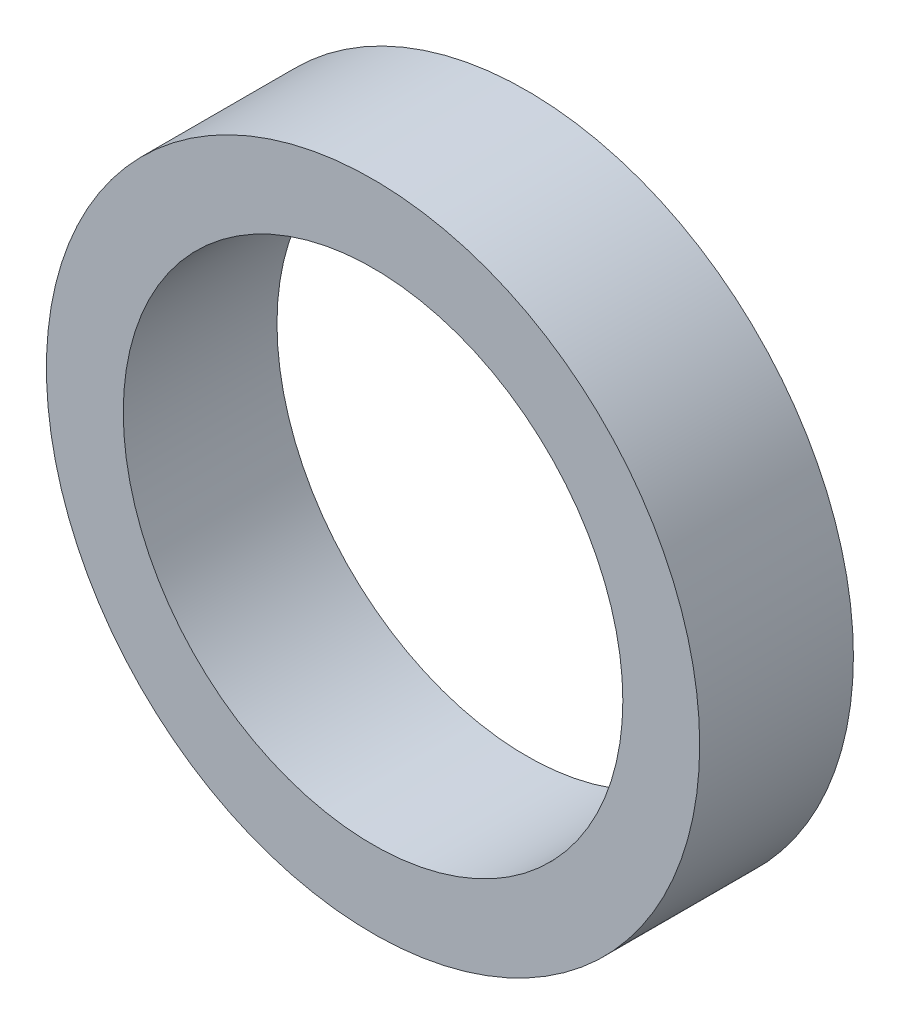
from build123d import *

# Parameters (mm, degrees)
SKETCH1_R      = 26.9875
SKETCH1_R_2    = 20.6375
EXTRUDE1_DEPTH = 12.7


with BuildPart() as part:
    # Sketch1 → Extrude1 (new body)
    with BuildSketch(Plane.XY):
        Circle(SKETCH1_R)
        Circle(SKETCH1_R_2, mode=Mode.SUBTRACT)
    extrude(amount=EXTRUDE1_DEPTH)


solid = part.part
